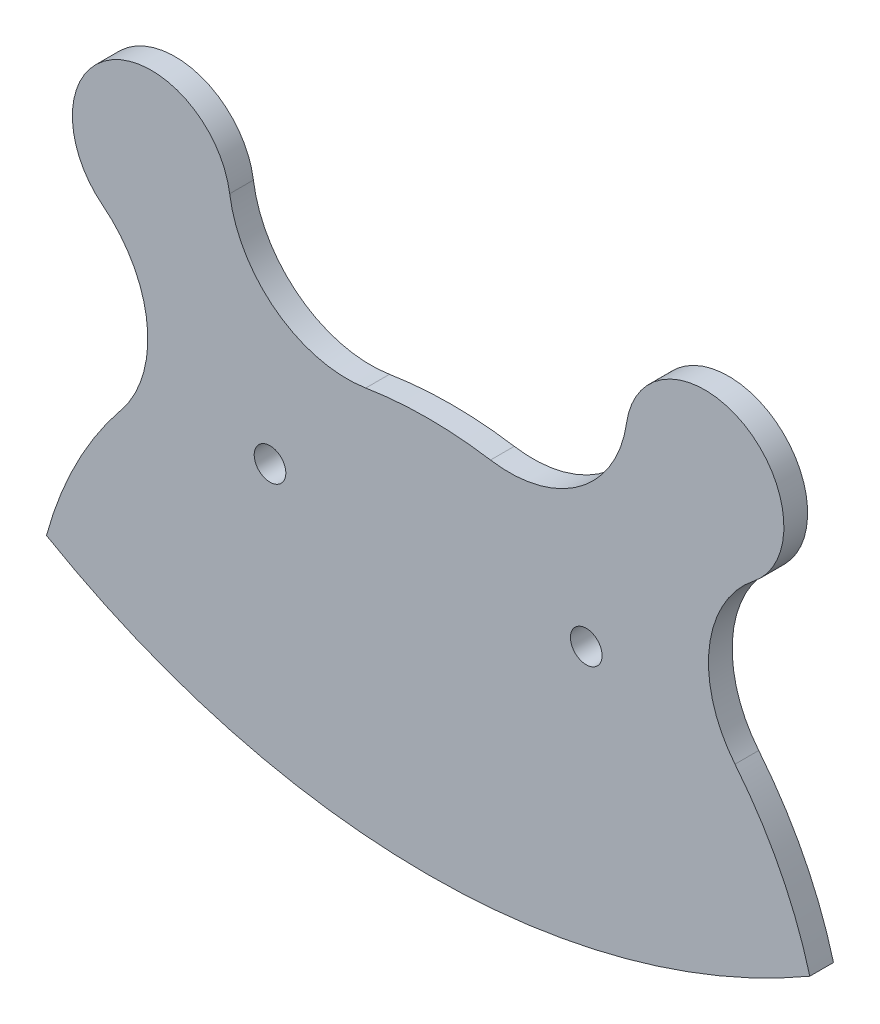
from build123d import *

# Parameters (mm, degrees)
SKETCH2_R      = 2
EXTRUDE1_DEPTH = 3


with BuildPart() as part:
    # Sketch2 → Extrude1 (new body)
    with BuildSketch(Plane.XY):
        with BuildLine():
            ThreePointArc((7.888739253, 49.373756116), (0, 50), (-7.888739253, 49.373756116))
            ThreePointArc((-7.888739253, 49.373756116), (-19.148844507, 52.106729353), (-25.102144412, 62.047420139))
            ThreePointArc((-25.102144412, 62.047420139), (-40, 69.282032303), (-41.183569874, 52.76280482))
            ThreePointArc((-41.183569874, 52.76280482), (-35.551329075, 42.636750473), (-38.81455745, 31.518726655))
            ThreePointArc((-38.81455745, 31.518726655), (-44.516095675, 22.766581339), (-48.274816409, 13.020833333))
            ThreePointArc((-48.274816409, 13.020833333), (0, 0), (48.274816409, 13.020833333))
            ThreePointArc((48.274816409, 13.020833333), (44.516095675, 22.766581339), (38.81455745, 31.518726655))
            ThreePointArc((38.81455745, 31.518726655), (35.551329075, 42.636750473), (41.183569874, 52.76280482))
            ThreePointArc((41.183569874, 52.76280482), (40, 69.282032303), (25.102144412, 62.047420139))
            ThreePointArc((25.102144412, 62.047420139), (19.148844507, 52.106729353), (7.888739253, 49.373756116))
        make_face()
        with Locations((-20, 35)):
            Circle(SKETCH2_R, mode=Mode.SUBTRACT)
        with Locations((20, 35)):
            Circle(SKETCH2_R, mode=Mode.SUBTRACT)
    extrude(amount=EXTRUDE1_DEPTH)


solid = part.part
